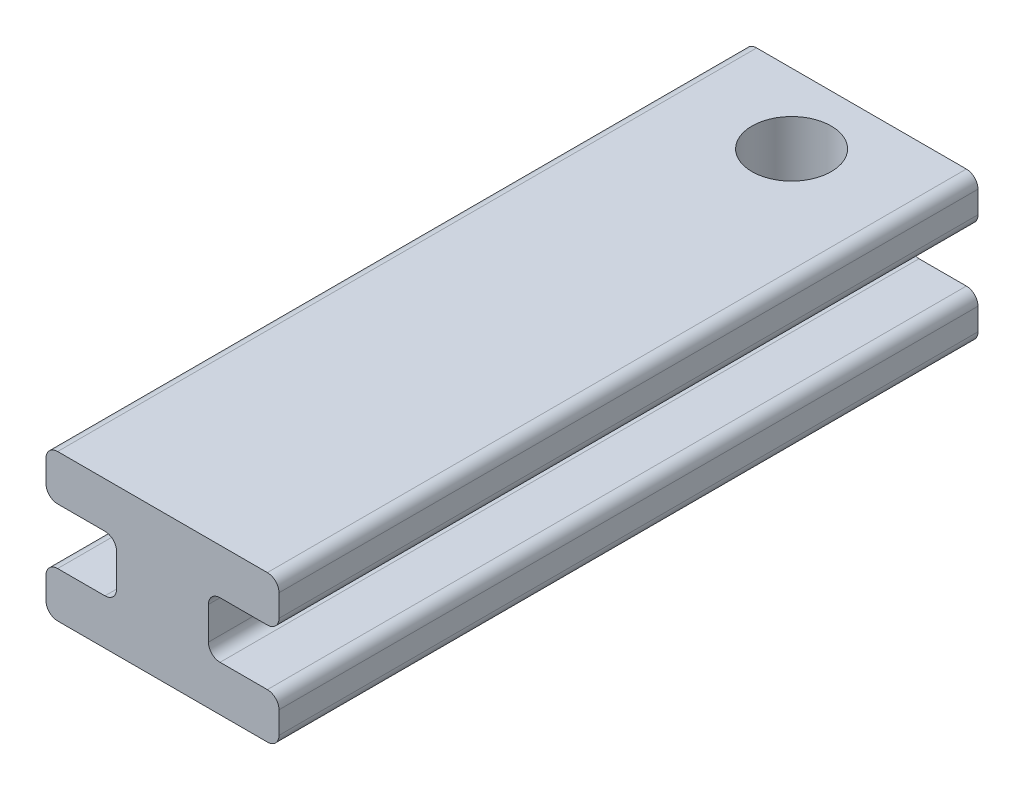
ISO-10303-21;
HEADER;
FILE_DESCRIPTION(('STEP AP214'),'2;1');
FILE_NAME('part.step','',(''),(''),'','','');
FILE_SCHEMA(('AUTOMOTIVE_DESIGN { 1 0 10303 214 1 1 1 1 }'));
ENDSEC;
DATA;
#1=APPLICATION_CONTEXT('core data for automotive mechanical design processes');
#2=APPLICATION_PROTOCOL_DEFINITION('international standard','automotive_design',2000,#1);
#3=PRODUCT_CONTEXT('',#1,'mechanical');
#4=PRODUCT('Part','Part','',(#3));
#5=PRODUCT_RELATED_PRODUCT_CATEGORY('part','',(#4));
#6=PRODUCT_DEFINITION_FORMATION('','',#4);
#7=PRODUCT_DEFINITION_CONTEXT('part definition',#1,'design');
#8=PRODUCT_DEFINITION('design','',#6,#7);
#9=PRODUCT_DEFINITION_SHAPE('','',#8);
#10=(LENGTH_UNIT() NAMED_UNIT(*) SI_UNIT(.MILLI.,.METRE.));
#11=(NAMED_UNIT(*) PLANE_ANGLE_UNIT() SI_UNIT($,.RADIAN.));
#12=(NAMED_UNIT(*) SI_UNIT($,.STERADIAN.) SOLID_ANGLE_UNIT());
#13=UNCERTAINTY_MEASURE_WITH_UNIT(LENGTH_MEASURE(1.E-05),#10,'distance_accuracy_value','');
#14=(GEOMETRIC_REPRESENTATION_CONTEXT(3) GLOBAL_UNCERTAINTY_ASSIGNED_CONTEXT((#13)) GLOBAL_UNIT_ASSIGNED_CONTEXT((#10,
#11,#12)) REPRESENTATION_CONTEXT('',''));
#15=CARTESIAN_POINT('',(0.,0.,0.));
#16=DIRECTION('',(0.,0.,1.));
#17=DIRECTION('',(1.,0.,0.));
#18=AXIS2_PLACEMENT_3D('',#15,#16,#17);
#19=CARTESIAN_POINT('',(5.00000000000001,3.15,30.));
#20=DIRECTION('',(-1.,0.,0.));
#21=DIRECTION('',(0.,-1.,0.));
#22=AXIS2_PLACEMENT_3D('',#19,#20,#21);
#23=PLANE('',#22);
#24=DIRECTION('',(0.,1.,0.));
#25=VECTOR('',#24,1.);
#26=CARTESIAN_POINT('',(5.00000000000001,3.15,30.));
#27=LINE('',#26,#25);
#28=CARTESIAN_POINT('',(5.,1.7,30.));
#29=VERTEX_POINT('',#28);
#30=CARTESIAN_POINT('',(5.00000000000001,2.65,30.));
#31=VERTEX_POINT('',#30);
#32=EDGE_CURVE('E237',#29,#31,#27,.T.);
#33=ORIENTED_EDGE('',*,*,#32,.F.);
#34=DIRECTION('',(0.,0.,-1.));
#35=VECTOR('',#34,1.);
#36=CARTESIAN_POINT('',(5.,1.7,30.));
#37=LINE('',#36,#35);
#38=CARTESIAN_POINT('',(5.,1.7,0.));
#39=VERTEX_POINT('',#38);
#40=EDGE_CURVE('E278',#29,#39,#37,.T.);
#41=ORIENTED_EDGE('',*,*,#40,.T.);
#42=DIRECTION('',(0.,1.,0.));
#43=VECTOR('',#42,1.);
#44=CARTESIAN_POINT('',(5.00000000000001,3.15,0.));
#45=LINE('',#44,#43);
#46=CARTESIAN_POINT('',(5.00000000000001,2.65,0.));
#47=VERTEX_POINT('',#46);
#48=EDGE_CURVE('E378',#39,#47,#45,.T.);
#49=ORIENTED_EDGE('',*,*,#48,.T.);
#50=DIRECTION('',(0.,0.,-1.));
#51=VECTOR('',#50,1.);
#52=CARTESIAN_POINT('',(5.00000000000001,2.65,30.));
#53=LINE('',#52,#51);
#54=EDGE_CURVE('E276',#47,#31,#53,.F.);
#55=ORIENTED_EDGE('',*,*,#54,.T.);
#56=EDGE_LOOP('',(#33,#41,#49,#55));
#57=FACE_BOUND('',#56,.T.);
#58=ADVANCED_FACE('F35',(#57),#23,.F.);
#59=CARTESIAN_POINT('',(-4.99999999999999,3.15,30.));
#60=DIRECTION('',(0.,-1.,0.));
#61=DIRECTION('',(1.,0.,0.));
#62=AXIS2_PLACEMENT_3D('',#59,#60,#61);
#63=PLANE('',#62);
#64=CARTESIAN_POINT('',(0.,3.15,3.));
#65=DIRECTION('',(0.,1.,0.));
#66=DIRECTION('',(-1.,0.,0.));
#67=AXIS2_PLACEMENT_3D('',#64,#65,#66);
#68=CIRCLE('',#67,1.7);
#69=CARTESIAN_POINT('',(-1.7,3.15,3.));
#70=VERTEX_POINT('',#69);
#71=EDGE_CURVE('E486',#70,#70,#68,.T.);
#72=ORIENTED_EDGE('',*,*,#71,.F.);
#73=EDGE_LOOP('',(#72));
#74=FACE_BOUND('',#73,.T.);
#75=DIRECTION('',(-1.,0.,0.));
#76=VECTOR('',#75,1.);
#77=CARTESIAN_POINT('',(-4.99999999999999,3.15,30.));
#78=LINE('',#77,#76);
#79=CARTESIAN_POINT('',(4.50000000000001,3.15,30.));
#80=VERTEX_POINT('',#79);
#81=CARTESIAN_POINT('',(-4.5,3.15,30.));
#82=VERTEX_POINT('',#81);
#83=EDGE_CURVE('E478',#80,#82,#78,.T.);
#84=ORIENTED_EDGE('',*,*,#83,.F.);
#85=DIRECTION('',(0.,0.,-1.));
#86=VECTOR('',#85,1.);
#87=CARTESIAN_POINT('',(4.50000000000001,3.15,30.));
#88=LINE('',#87,#86);
#89=CARTESIAN_POINT('',(4.50000000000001,3.15,0.));
#90=VERTEX_POINT('',#89);
#91=EDGE_CURVE('E287',#80,#90,#88,.T.);
#92=ORIENTED_EDGE('',*,*,#91,.T.);
#93=DIRECTION('',(-1.,0.,0.));
#94=VECTOR('',#93,1.);
#95=CARTESIAN_POINT('',(-4.99999999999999,3.15,0.));
#96=LINE('',#95,#94);
#97=CARTESIAN_POINT('',(-4.5,3.15,0.));
#98=VERTEX_POINT('',#97);
#99=EDGE_CURVE('E381',#90,#98,#96,.T.);
#100=ORIENTED_EDGE('',*,*,#99,.T.);
#101=DIRECTION('',(0.,0.,-1.));
#102=VECTOR('',#101,1.);
#103=CARTESIAN_POINT('',(-4.5,3.15,30.));
#104=LINE('',#103,#102);
#105=EDGE_CURVE('E285',#98,#82,#104,.F.);
#106=ORIENTED_EDGE('',*,*,#105,.T.);
#107=EDGE_LOOP('',(#84,#92,#100,#106));
#108=FACE_BOUND('',#107,.T.);
#109=ADVANCED_FACE('F417',(#74,#108),#63,.F.);
#110=CARTESIAN_POINT('',(-4.99999999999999,3.15,30.));
#111=DIRECTION('',(1.,0.,0.));
#112=DIRECTION('',(0.,1.,0.));
#113=AXIS2_PLACEMENT_3D('',#110,#111,#112);
#114=PLANE('',#113);
#115=DIRECTION('',(0.,-1.,0.));
#116=VECTOR('',#115,1.);
#117=CARTESIAN_POINT('',(-4.99999999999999,3.15,30.));
#118=LINE('',#117,#116);
#119=CARTESIAN_POINT('',(-4.99999999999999,2.65,30.));
#120=VERTEX_POINT('',#119);
#121=CARTESIAN_POINT('',(-4.99999999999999,1.7,30.));
#122=VERTEX_POINT('',#121);
#123=EDGE_CURVE('E363',#120,#122,#118,.T.);
#124=ORIENTED_EDGE('',*,*,#123,.F.);
#125=DIRECTION('',(0.,0.,-1.));
#126=VECTOR('',#125,1.);
#127=CARTESIAN_POINT('',(-4.99999999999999,2.65,30.));
#128=LINE('',#127,#126);
#129=CARTESIAN_POINT('',(-4.99999999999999,2.65,0.));
#130=VERTEX_POINT('',#129);
#131=EDGE_CURVE('E317',#120,#130,#128,.T.);
#132=ORIENTED_EDGE('',*,*,#131,.T.);
#133=DIRECTION('',(0.,-1.,0.));
#134=VECTOR('',#133,1.);
#135=CARTESIAN_POINT('',(-4.99999999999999,3.15,0.));
#136=LINE('',#135,#134);
#137=CARTESIAN_POINT('',(-4.99999999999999,1.7,0.));
#138=VERTEX_POINT('',#137);
#139=EDGE_CURVE('E344',#130,#138,#136,.T.);
#140=ORIENTED_EDGE('',*,*,#139,.T.);
#141=DIRECTION('',(0.,0.,-1.));
#142=VECTOR('',#141,1.);
#143=CARTESIAN_POINT('',(-4.99999999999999,1.7,30.));
#144=LINE('',#143,#142);
#145=EDGE_CURVE('E315',#138,#122,#144,.F.);
#146=ORIENTED_EDGE('',*,*,#145,.T.);
#147=EDGE_LOOP('',(#124,#132,#140,#146));
#148=FACE_BOUND('',#147,.T.);
#149=ADVANCED_FACE('F423',(#148),#114,.F.);
#150=CARTESIAN_POINT('',(-4.99999999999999,1.2,30.));
#151=DIRECTION('',(0.,1.,0.));
#152=DIRECTION('',(-1.,0.,0.));
#153=AXIS2_PLACEMENT_3D('',#150,#151,#152);
#154=PLANE('',#153);
#155=DIRECTION('',(1.,0.,0.));
#156=VECTOR('',#155,1.);
#157=CARTESIAN_POINT('',(-4.99999999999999,1.2,0.));
#158=LINE('',#157,#156);
#159=CARTESIAN_POINT('',(-4.49999999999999,1.2,0.));
#160=VERTEX_POINT('',#159);
#161=CARTESIAN_POINT('',(-2.46999999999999,1.2,0.));
#162=VERTEX_POINT('',#161);
#163=EDGE_CURVE('E333',#160,#162,#158,.T.);
#164=ORIENTED_EDGE('',*,*,#163,.T.);
#165=DIRECTION('',(0.,0.,-1.));
#166=VECTOR('',#165,1.);
#167=CARTESIAN_POINT('',(-2.46999999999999,1.2,30.));
#168=LINE('',#167,#166);
#169=CARTESIAN_POINT('',(-2.46999999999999,1.2,30.));
#170=VERTEX_POINT('',#169);
#171=EDGE_CURVE('E308',#162,#170,#168,.F.);
#172=ORIENTED_EDGE('',*,*,#171,.T.);
#173=DIRECTION('',(1.,0.,0.));
#174=VECTOR('',#173,1.);
#175=CARTESIAN_POINT('',(-4.99999999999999,1.2,30.));
#176=LINE('',#175,#174);
#177=CARTESIAN_POINT('',(-4.49999999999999,1.2,30.));
#178=VERTEX_POINT('',#177);
#179=EDGE_CURVE('E354',#178,#170,#176,.T.);
#180=ORIENTED_EDGE('',*,*,#179,.F.);
#181=DIRECTION('',(0.,0.,-1.));
#182=VECTOR('',#181,1.);
#183=CARTESIAN_POINT('',(-4.49999999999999,1.2,30.));
#184=LINE('',#183,#182);
#185=EDGE_CURVE('E305',#178,#160,#184,.T.);
#186=ORIENTED_EDGE('',*,*,#185,.T.);
#187=EDGE_LOOP('',(#164,#172,#180,#186));
#188=FACE_BOUND('',#187,.T.);
#189=ADVANCED_FACE('F340',(#188),#154,.F.);
#190=CARTESIAN_POINT('',(-1.96999999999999,1.2,30.));
#191=DIRECTION('',(1.,0.,0.));
#192=DIRECTION('',(0.,0.,-1.));
#193=AXIS2_PLACEMENT_3D('',#190,#191,#192);
#194=PLANE('',#193);
#195=DIRECTION('',(0.,-1.,0.));
#196=VECTOR('',#195,1.);
#197=CARTESIAN_POINT('',(-1.96999999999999,1.2,0.));
#198=LINE('',#197,#196);
#199=CARTESIAN_POINT('',(-1.96999999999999,0.700000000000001,0.));
#200=VERTEX_POINT('',#199);
#201=CARTESIAN_POINT('',(-1.96999999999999,-0.700000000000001,0.));
#202=VERTEX_POINT('',#201);
#203=EDGE_CURVE('E335',#200,#202,#198,.T.);
#204=ORIENTED_EDGE('',*,*,#203,.T.);
#205=DIRECTION('',(0.,0.,-1.));
#206=VECTOR('',#205,1.);
#207=CARTESIAN_POINT('',(-1.96999999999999,-0.700000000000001,30.));
#208=LINE('',#207,#206);
#209=CARTESIAN_POINT('',(-1.96999999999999,-0.700000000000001,30.));
#210=VERTEX_POINT('',#209);
#211=EDGE_CURVE('E303',#202,#210,#208,.F.);
#212=ORIENTED_EDGE('',*,*,#211,.T.);
#213=DIRECTION('',(0.,-1.,0.));
#214=VECTOR('',#213,1.);
#215=CARTESIAN_POINT('',(-1.96999999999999,1.2,30.));
#216=LINE('',#215,#214);
#217=CARTESIAN_POINT('',(-1.96999999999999,0.700000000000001,30.));
#218=VERTEX_POINT('',#217);
#219=EDGE_CURVE('E352',#218,#210,#216,.T.);
#220=ORIENTED_EDGE('',*,*,#219,.F.);
#221=DIRECTION('',(0.,0.,-1.));
#222=VECTOR('',#221,1.);
#223=CARTESIAN_POINT('',(-1.96999999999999,0.700000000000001,0.));
#224=LINE('',#223,#222);
#225=EDGE_CURVE('E300',#218,#200,#224,.T.);
#226=ORIENTED_EDGE('',*,*,#225,.T.);
#227=EDGE_LOOP('',(#204,#212,#220,#226));
#228=FACE_BOUND('',#227,.T.);
#229=ADVANCED_FACE('F356',(#228),#194,.F.);
#230=CARTESIAN_POINT('',(-4.99999999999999,-1.2,30.));
#231=DIRECTION('',(0.,-1.,0.));
#232=DIRECTION('',(1.,0.,0.));
#233=AXIS2_PLACEMENT_3D('',#230,#231,#232);
#234=PLANE('',#233);
#235=DIRECTION('',(-1.,0.,0.));
#236=VECTOR('',#235,1.);
#237=CARTESIAN_POINT('',(-4.99999999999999,-1.2,30.));
#238=LINE('',#237,#236);
#239=CARTESIAN_POINT('',(-2.46999999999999,-1.2,30.));
#240=VERTEX_POINT('',#239);
#241=CARTESIAN_POINT('',(-4.49999999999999,-1.2,30.));
#242=VERTEX_POINT('',#241);
#243=EDGE_CURVE('E358',#240,#242,#238,.T.);
#244=ORIENTED_EDGE('',*,*,#243,.F.);
#245=DIRECTION('',(0.,0.,-1.));
#246=VECTOR('',#245,1.);
#247=CARTESIAN_POINT('',(-2.46999999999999,-1.2,0.));
#248=LINE('',#247,#246);
#249=CARTESIAN_POINT('',(-2.46999999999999,-1.2,0.));
#250=VERTEX_POINT('',#249);
#251=EDGE_CURVE('E297',#240,#250,#248,.T.);
#252=ORIENTED_EDGE('',*,*,#251,.T.);
#253=DIRECTION('',(-1.,0.,0.));
#254=VECTOR('',#253,1.);
#255=CARTESIAN_POINT('',(-4.99999999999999,-1.2,0.));
#256=LINE('',#255,#254);
#257=CARTESIAN_POINT('',(-4.49999999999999,-1.2,0.));
#258=VERTEX_POINT('',#257);
#259=EDGE_CURVE('E388',#250,#258,#256,.T.);
#260=ORIENTED_EDGE('',*,*,#259,.T.);
#261=DIRECTION('',(0.,0.,-1.));
#262=VECTOR('',#261,1.);
#263=CARTESIAN_POINT('',(-4.49999999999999,-1.2,30.));
#264=LINE('',#263,#262);
#265=EDGE_CURVE('E295',#258,#242,#264,.F.);
#266=ORIENTED_EDGE('',*,*,#265,.T.);
#267=EDGE_LOOP('',(#244,#252,#260,#266));
#268=FACE_BOUND('',#267,.T.);
#269=ADVANCED_FACE('F413',(#268),#234,.F.);
#270=CARTESIAN_POINT('',(-4.99999999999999,-3.15,30.));
#271=DIRECTION('',(1.,0.,0.));
#272=DIRECTION('',(0.,1.,0.));
#273=AXIS2_PLACEMENT_3D('',#270,#271,#272);
#274=PLANE('',#273);
#275=DIRECTION('',(0.,-1.,0.));
#276=VECTOR('',#275,1.);
#277=CARTESIAN_POINT('',(-4.99999999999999,-3.15,0.));
#278=LINE('',#277,#276);
#279=CARTESIAN_POINT('',(-4.99999999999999,-1.7,0.));
#280=VERTEX_POINT('',#279);
#281=CARTESIAN_POINT('',(-4.99999999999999,-2.65,0.));
#282=VERTEX_POINT('',#281);
#283=EDGE_CURVE('E229',#280,#282,#278,.T.);
#284=ORIENTED_EDGE('',*,*,#283,.T.);
#285=DIRECTION('',(0.,0.,-1.));
#286=VECTOR('',#285,1.);
#287=CARTESIAN_POINT('',(-4.99999999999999,-2.65,30.));
#288=LINE('',#287,#286);
#289=CARTESIAN_POINT('',(-4.99999999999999,-2.65,30.));
#290=VERTEX_POINT('',#289);
#291=EDGE_CURVE('E313',#282,#290,#288,.F.);
#292=ORIENTED_EDGE('',*,*,#291,.T.);
#293=DIRECTION('',(0.,-1.,0.));
#294=VECTOR('',#293,1.);
#295=CARTESIAN_POINT('',(-4.99999999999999,-3.15,30.));
#296=LINE('',#295,#294);
#297=CARTESIAN_POINT('',(-4.99999999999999,-1.7,30.));
#298=VERTEX_POINT('',#297);
#299=EDGE_CURVE('E361',#298,#290,#296,.T.);
#300=ORIENTED_EDGE('',*,*,#299,.F.);
#301=DIRECTION('',(0.,0.,-1.));
#302=VECTOR('',#301,1.);
#303=CARTESIAN_POINT('',(-4.99999999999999,-1.7,30.));
#304=LINE('',#303,#302);
#305=EDGE_CURVE('E310',#298,#280,#304,.T.);
#306=ORIENTED_EDGE('',*,*,#305,.T.);
#307=EDGE_LOOP('',(#284,#292,#300,#306));
#308=FACE_BOUND('',#307,.T.);
#309=ADVANCED_FACE('F394',(#308),#274,.F.);
#310=CARTESIAN_POINT('',(-4.99999999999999,-3.15,30.));
#311=DIRECTION('',(0.,1.,0.));
#312=DIRECTION('',(-1.,0.,0.));
#313=AXIS2_PLACEMENT_3D('',#310,#311,#312);
#314=PLANE('',#313);
#315=CARTESIAN_POINT('',(0.,-3.15,3.));
#316=DIRECTION('',(0.,1.,0.));
#317=DIRECTION('',(-1.,0.,0.));
#318=AXIS2_PLACEMENT_3D('',#315,#316,#317);
#319=CIRCLE('',#318,1.7);
#320=CARTESIAN_POINT('',(-1.7,-3.15,3.));
#321=VERTEX_POINT('',#320);
#322=EDGE_CURVE('E382',#321,#321,#319,.T.);
#323=ORIENTED_EDGE('',*,*,#322,.T.);
#324=EDGE_LOOP('',(#323));
#325=FACE_BOUND('',#324,.T.);
#326=DIRECTION('',(1.,0.,0.));
#327=VECTOR('',#326,1.);
#328=CARTESIAN_POINT('',(-4.99999999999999,-3.15,0.));
#329=LINE('',#328,#327);
#330=CARTESIAN_POINT('',(-4.5,-3.15,0.));
#331=VERTEX_POINT('',#330);
#332=CARTESIAN_POINT('',(4.50000000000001,-3.15,0.));
#333=VERTEX_POINT('',#332);
#334=EDGE_CURVE('E224',#331,#333,#329,.T.);
#335=ORIENTED_EDGE('',*,*,#334,.T.);
#336=DIRECTION('',(0.,0.,-1.));
#337=VECTOR('',#336,1.);
#338=CARTESIAN_POINT('',(4.50000000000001,-3.15,30.));
#339=LINE('',#338,#337);
#340=CARTESIAN_POINT('',(4.50000000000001,-3.15,30.));
#341=VERTEX_POINT('',#340);
#342=EDGE_CURVE('E202',#333,#341,#339,.F.);
#343=ORIENTED_EDGE('',*,*,#342,.T.);
#344=DIRECTION('',(1.,0.,0.));
#345=VECTOR('',#344,1.);
#346=CARTESIAN_POINT('',(-4.99999999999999,-3.15,30.));
#347=LINE('',#346,#345);
#348=CARTESIAN_POINT('',(-4.5,-3.15,30.));
#349=VERTEX_POINT('',#348);
#350=EDGE_CURVE('E369',#349,#341,#347,.T.);
#351=ORIENTED_EDGE('',*,*,#350,.F.);
#352=DIRECTION('',(0.,0.,-1.));
#353=VECTOR('',#352,1.);
#354=CARTESIAN_POINT('',(-4.5,-3.15,30.));
#355=LINE('',#354,#353);
#356=EDGE_CURVE('E207',#349,#331,#355,.T.);
#357=ORIENTED_EDGE('',*,*,#356,.T.);
#358=EDGE_LOOP('',(#335,#343,#351,#357));
#359=FACE_BOUND('',#358,.T.);
#360=ADVANCED_FACE('F403',(#325,#359),#314,.F.);
#361=CARTESIAN_POINT('',(5.00000000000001,-3.15,30.));
#362=DIRECTION('',(-1.,0.,0.));
#363=DIRECTION('',(0.,-1.,0.));
#364=AXIS2_PLACEMENT_3D('',#361,#362,#363);
#365=PLANE('',#364);
#366=DIRECTION('',(0.,1.,0.));
#367=VECTOR('',#366,1.);
#368=CARTESIAN_POINT('',(5.00000000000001,-3.15,30.));
#369=LINE('',#368,#367);
#370=CARTESIAN_POINT('',(5.00000000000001,-2.65,30.));
#371=VERTEX_POINT('',#370);
#372=CARTESIAN_POINT('',(5.,-1.7,30.));
#373=VERTEX_POINT('',#372);
#374=EDGE_CURVE('E217',#371,#373,#369,.T.);
#375=ORIENTED_EDGE('',*,*,#374,.F.);
#376=DIRECTION('',(0.,0.,-1.));
#377=VECTOR('',#376,1.);
#378=CARTESIAN_POINT('',(5.00000000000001,-2.65,30.));
#379=LINE('',#378,#377);
#380=CARTESIAN_POINT('',(5.00000000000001,-2.65,0.));
#381=VERTEX_POINT('',#380);
#382=EDGE_CURVE('E201',#371,#381,#379,.T.);
#383=ORIENTED_EDGE('',*,*,#382,.T.);
#384=DIRECTION('',(0.,1.,0.));
#385=VECTOR('',#384,1.);
#386=CARTESIAN_POINT('',(5.00000000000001,-3.15,0.));
#387=LINE('',#386,#385);
#388=CARTESIAN_POINT('',(5.,-1.7,0.));
#389=VERTEX_POINT('',#388);
#390=EDGE_CURVE('E214',#381,#389,#387,.T.);
#391=ORIENTED_EDGE('',*,*,#390,.T.);
#392=DIRECTION('',(0.,0.,-1.));
#393=VECTOR('',#392,1.);
#394=CARTESIAN_POINT('',(5.,-1.7,30.));
#395=LINE('',#394,#393);
#396=EDGE_CURVE('E219',#389,#373,#395,.F.);
#397=ORIENTED_EDGE('',*,*,#396,.T.);
#398=EDGE_LOOP('',(#375,#383,#391,#397));
#399=FACE_BOUND('',#398,.T.);
#400=ADVANCED_FACE('F213',(#399),#365,.F.);
#401=CARTESIAN_POINT('',(5.,-1.2,30.));
#402=DIRECTION('',(0.,-1.,0.));
#403=DIRECTION('',(1.,0.,0.));
#404=AXIS2_PLACEMENT_3D('',#401,#402,#403);
#405=PLANE('',#404);
#406=DIRECTION('',(-1.,0.,0.));
#407=VECTOR('',#406,1.);
#408=CARTESIAN_POINT('',(5.,-1.2,30.));
#409=LINE('',#408,#407);
#410=CARTESIAN_POINT('',(4.5,-1.2,30.));
#411=VERTEX_POINT('',#410);
#412=CARTESIAN_POINT('',(2.47000000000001,-1.2,30.));
#413=VERTEX_POINT('',#412);
#414=EDGE_CURVE('E372',#411,#413,#409,.T.);
#415=ORIENTED_EDGE('',*,*,#414,.F.);
#416=DIRECTION('',(0.,0.,-1.));
#417=VECTOR('',#416,1.);
#418=CARTESIAN_POINT('',(4.5,-1.2,30.));
#419=LINE('',#418,#417);
#420=CARTESIAN_POINT('',(4.5,-1.2,0.));
#421=VERTEX_POINT('',#420);
#422=EDGE_CURVE('E273',#411,#421,#419,.T.);
#423=ORIENTED_EDGE('',*,*,#422,.T.);
#424=DIRECTION('',(-1.,0.,0.));
#425=VECTOR('',#424,1.);
#426=CARTESIAN_POINT('',(5.,-1.2,0.));
#427=LINE('',#426,#425);
#428=CARTESIAN_POINT('',(2.47000000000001,-1.2,0.));
#429=VERTEX_POINT('',#428);
#430=EDGE_CURVE('E223',#421,#429,#427,.T.);
#431=ORIENTED_EDGE('',*,*,#430,.T.);
#432=DIRECTION('',(0.,0.,-1.));
#433=VECTOR('',#432,1.);
#434=CARTESIAN_POINT('',(2.47000000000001,-1.2,30.));
#435=LINE('',#434,#433);
#436=EDGE_CURVE('E271',#429,#413,#435,.F.);
#437=ORIENTED_EDGE('',*,*,#436,.T.);
#438=EDGE_LOOP('',(#415,#423,#431,#437));
#439=FACE_BOUND('',#438,.T.);
#440=ADVANCED_FACE('F411',(#439),#405,.F.);
#441=CARTESIAN_POINT('',(1.97,1.2,30.));
#442=DIRECTION('',(-1.,0.,0.));
#443=DIRECTION('',(0.,-1.,0.));
#444=AXIS2_PLACEMENT_3D('',#441,#442,#443);
#445=PLANE('',#444);
#446=DIRECTION('',(0.,1.,0.));
#447=VECTOR('',#446,1.);
#448=CARTESIAN_POINT('',(1.97,0.,30.));
#449=LINE('',#448,#447);
#450=CARTESIAN_POINT('',(1.97,-0.7,30.));
#451=VERTEX_POINT('',#450);
#452=CARTESIAN_POINT('',(1.97000000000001,0.7,30.));
#453=VERTEX_POINT('',#452);
#454=EDGE_CURVE('E375',#451,#453,#449,.T.);
#455=ORIENTED_EDGE('',*,*,#454,.F.);
#456=DIRECTION('',(0.,0.,-1.));
#457=VECTOR('',#456,1.);
#458=CARTESIAN_POINT('',(1.97000000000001,-0.7,0.));
#459=LINE('',#458,#457);
#460=CARTESIAN_POINT('',(1.97000000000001,-0.7,0.));
#461=VERTEX_POINT('',#460);
#462=EDGE_CURVE('E292',#451,#461,#459,.T.);
#463=ORIENTED_EDGE('',*,*,#462,.T.);
#464=DIRECTION('',(0.,1.,0.));
#465=VECTOR('',#464,1.);
#466=CARTESIAN_POINT('',(1.97,1.2,0.));
#467=LINE('',#466,#465);
#468=CARTESIAN_POINT('',(1.97,0.7,0.));
#469=VERTEX_POINT('',#468);
#470=EDGE_CURVE('E227',#461,#469,#467,.T.);
#471=ORIENTED_EDGE('',*,*,#470,.T.);
#472=DIRECTION('',(0.,0.,-1.));
#473=VECTOR('',#472,1.);
#474=CARTESIAN_POINT('',(1.97,0.7,30.));
#475=LINE('',#474,#473);
#476=EDGE_CURVE('E290',#469,#453,#475,.F.);
#477=ORIENTED_EDGE('',*,*,#476,.T.);
#478=EDGE_LOOP('',(#455,#463,#471,#477));
#479=FACE_BOUND('',#478,.T.);
#480=ADVANCED_FACE('F510',(#479),#445,.F.);
#481=CARTESIAN_POINT('',(5.,1.2,30.));
#482=DIRECTION('',(0.,1.,0.));
#483=DIRECTION('',(-1.,0.,0.));
#484=AXIS2_PLACEMENT_3D('',#481,#482,#483);
#485=PLANE('',#484);
#486=DIRECTION('',(1.,0.,0.));
#487=VECTOR('',#486,1.);
#488=CARTESIAN_POINT('',(5.,1.2,0.));
#489=LINE('',#488,#487);
#490=CARTESIAN_POINT('',(2.47000000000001,1.2,0.));
#491=VERTEX_POINT('',#490);
#492=CARTESIAN_POINT('',(4.5,1.2,0.));
#493=VERTEX_POINT('',#492);
#494=EDGE_CURVE('E235',#491,#493,#489,.T.);
#495=ORIENTED_EDGE('',*,*,#494,.T.);
#496=DIRECTION('',(0.,0.,-1.));
#497=VECTOR('',#496,1.);
#498=CARTESIAN_POINT('',(4.5,1.2,30.));
#499=LINE('',#498,#497);
#500=CARTESIAN_POINT('',(4.5,1.2,30.));
#501=VERTEX_POINT('',#500);
#502=EDGE_CURVE('E50',#493,#501,#499,.F.);
#503=ORIENTED_EDGE('',*,*,#502,.T.);
#504=DIRECTION('',(1.,0.,0.));
#505=VECTOR('',#504,1.);
#506=CARTESIAN_POINT('',(5.,1.2,30.));
#507=LINE('',#506,#505);
#508=CARTESIAN_POINT('',(2.47000000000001,1.2,30.));
#509=VERTEX_POINT('',#508);
#510=EDGE_CURVE('E238',#509,#501,#507,.T.);
#511=ORIENTED_EDGE('',*,*,#510,.F.);
#512=DIRECTION('',(0.,0.,-1.));
#513=VECTOR('',#512,1.);
#514=CARTESIAN_POINT('',(2.47,1.2,0.));
#515=LINE('',#514,#513);
#516=EDGE_CURVE('E281',#509,#491,#515,.T.);
#517=ORIENTED_EDGE('',*,*,#516,.T.);
#518=EDGE_LOOP('',(#495,#503,#511,#517));
#519=FACE_BOUND('',#518,.T.);
#520=ADVANCED_FACE('F504',(#519),#485,.F.);
#521=CARTESIAN_POINT('',(0.,0.,30.));
#522=DIRECTION('',(0.,0.,-1.));
#523=DIRECTION('',(-1.,0.,0.));
#524=AXIS2_PLACEMENT_3D('',#521,#522,#523);
#525=PLANE('',#524);
#526=ORIENTED_EDGE('',*,*,#350,.T.);
#527=CARTESIAN_POINT('',(4.50000000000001,-2.65,30.));
#528=DIRECTION('',(0.,0.,-1.));
#529=DIRECTION('',(-1.,0.,0.));
#530=AXIS2_PLACEMENT_3D('',#527,#528,#529);
#531=CIRCLE('',#530,0.5);
#532=EDGE_CURVE('E269',#341,#371,#531,.F.);
#533=ORIENTED_EDGE('',*,*,#532,.T.);
#534=ORIENTED_EDGE('',*,*,#374,.T.);
#535=CARTESIAN_POINT('',(4.5,-1.7,30.));
#536=DIRECTION('',(0.,0.,-1.));
#537=DIRECTION('',(-1.,0.,0.));
#538=AXIS2_PLACEMENT_3D('',#535,#536,#537);
#539=CIRCLE('',#538,0.5);
#540=EDGE_CURVE('E267',#373,#411,#539,.F.);
#541=ORIENTED_EDGE('',*,*,#540,.T.);
#542=ORIENTED_EDGE('',*,*,#414,.T.);
#543=CARTESIAN_POINT('',(2.47000000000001,-0.7,30.));
#544=DIRECTION('',(0.,0.,-1.));
#545=DIRECTION('',(-1.,0.,0.));
#546=AXIS2_PLACEMENT_3D('',#543,#544,#545);
#547=CIRCLE('',#546,0.5);
#548=EDGE_CURVE('E322',#413,#451,#547,.T.);
#549=ORIENTED_EDGE('',*,*,#548,.T.);
#550=ORIENTED_EDGE('',*,*,#454,.T.);
#551=CARTESIAN_POINT('',(2.47,0.7,30.));
#552=DIRECTION('',(0.,0.,-1.));
#553=DIRECTION('',(-1.,0.,0.));
#554=AXIS2_PLACEMENT_3D('',#551,#552,#553);
#555=CIRCLE('',#554,0.5);
#556=EDGE_CURVE('E57',#453,#509,#555,.T.);
#557=ORIENTED_EDGE('',*,*,#556,.T.);
#558=ORIENTED_EDGE('',*,*,#510,.T.);
#559=CARTESIAN_POINT('',(4.5,1.7,30.));
#560=DIRECTION('',(0.,0.,-1.));
#561=DIRECTION('',(-1.,0.,0.));
#562=AXIS2_PLACEMENT_3D('',#559,#560,#561);
#563=CIRCLE('',#562,0.5);
#564=EDGE_CURVE('E265',#501,#29,#563,.F.);
#565=ORIENTED_EDGE('',*,*,#564,.T.);
#566=ORIENTED_EDGE('',*,*,#32,.T.);
#567=CARTESIAN_POINT('',(4.50000000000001,2.65,30.));
#568=DIRECTION('',(0.,0.,-1.));
#569=DIRECTION('',(-1.,0.,0.));
#570=AXIS2_PLACEMENT_3D('',#567,#568,#569);
#571=CIRCLE('',#570,0.5);
#572=EDGE_CURVE('E263',#31,#80,#571,.F.);
#573=ORIENTED_EDGE('',*,*,#572,.T.);
#574=ORIENTED_EDGE('',*,*,#83,.T.);
#575=CARTESIAN_POINT('',(-4.5,2.65,30.));
#576=DIRECTION('',(0.,0.,-1.));
#577=DIRECTION('',(-1.,0.,0.));
#578=AXIS2_PLACEMENT_3D('',#575,#576,#577);
#579=CIRCLE('',#578,0.5);
#580=EDGE_CURVE('E257',#82,#120,#579,.F.);
#581=ORIENTED_EDGE('',*,*,#580,.T.);
#582=ORIENTED_EDGE('',*,*,#123,.T.);
#583=CARTESIAN_POINT('',(-4.49999999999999,1.7,30.));
#584=DIRECTION('',(0.,0.,-1.));
#585=DIRECTION('',(-1.,0.,0.));
#586=AXIS2_PLACEMENT_3D('',#583,#584,#585);
#587=CIRCLE('',#586,0.5);
#588=EDGE_CURVE('E255',#122,#178,#587,.F.);
#589=ORIENTED_EDGE('',*,*,#588,.T.);
#590=ORIENTED_EDGE('',*,*,#179,.T.);
#591=CARTESIAN_POINT('',(-2.46999999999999,0.700000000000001,30.));
#592=DIRECTION('',(0.,0.,-1.));
#593=DIRECTION('',(-1.,0.,0.));
#594=AXIS2_PLACEMENT_3D('',#591,#592,#593);
#595=CIRCLE('',#594,0.5);
#596=EDGE_CURVE('E11',#170,#218,#595,.T.);
#597=ORIENTED_EDGE('',*,*,#596,.T.);
#598=ORIENTED_EDGE('',*,*,#219,.T.);
#599=CARTESIAN_POINT('',(-2.46999999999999,-0.700000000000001,30.));
#600=DIRECTION('',(0.,0.,-1.));
#601=DIRECTION('',(-1.,0.,0.));
#602=AXIS2_PLACEMENT_3D('',#599,#600,#601);
#603=CIRCLE('',#602,0.5);
#604=EDGE_CURVE('E329',#210,#240,#603,.T.);
#605=ORIENTED_EDGE('',*,*,#604,.T.);
#606=ORIENTED_EDGE('',*,*,#243,.T.);
#607=CARTESIAN_POINT('',(-4.49999999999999,-1.7,30.));
#608=DIRECTION('',(0.,0.,-1.));
#609=DIRECTION('',(-1.,0.,0.));
#610=AXIS2_PLACEMENT_3D('',#607,#608,#609);
#611=CIRCLE('',#610,0.5);
#612=EDGE_CURVE('E259',#242,#298,#611,.F.);
#613=ORIENTED_EDGE('',*,*,#612,.T.);
#614=ORIENTED_EDGE('',*,*,#299,.T.);
#615=CARTESIAN_POINT('',(-4.5,-2.65,30.));
#616=DIRECTION('',(0.,0.,-1.));
#617=DIRECTION('',(-1.,0.,0.));
#618=AXIS2_PLACEMENT_3D('',#615,#616,#617);
#619=CIRCLE('',#618,0.5);
#620=EDGE_CURVE('E261',#290,#349,#619,.F.);
#621=ORIENTED_EDGE('',*,*,#620,.T.);
#622=EDGE_LOOP('',(#526,#533,#534,#541,#542,#549,#550,#557,#558,#565,#566,#573,#574,#581,#582,
#589,#590,#597,#598,#605,#606,#613,#614,#621));
#623=FACE_BOUND('',#622,.T.);
#624=ADVANCED_FACE('F351',(#623),#525,.F.);
#625=CARTESIAN_POINT('',(0.,0.,0.));
#626=DIRECTION('',(0.,0.,-1.));
#627=DIRECTION('',(-1.,0.,0.));
#628=AXIS2_PLACEMENT_3D('',#625,#626,#627);
#629=PLANE('',#628);
#630=ORIENTED_EDGE('',*,*,#390,.F.);
#631=CARTESIAN_POINT('',(4.50000000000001,-2.65,0.));
#632=DIRECTION('',(0.,0.,-1.));
#633=DIRECTION('',(-1.,0.,0.));
#634=AXIS2_PLACEMENT_3D('',#631,#632,#633);
#635=CIRCLE('',#634,0.5);
#636=EDGE_CURVE('E197',#381,#333,#635,.T.);
#637=ORIENTED_EDGE('',*,*,#636,.T.);
#638=ORIENTED_EDGE('',*,*,#334,.F.);
#639=CARTESIAN_POINT('',(-4.5,-2.65,0.));
#640=DIRECTION('',(0.,0.,-1.));
#641=DIRECTION('',(-1.,0.,0.));
#642=AXIS2_PLACEMENT_3D('',#639,#640,#641);
#643=CIRCLE('',#642,0.5);
#644=EDGE_CURVE('E245',#331,#282,#643,.T.);
#645=ORIENTED_EDGE('',*,*,#644,.T.);
#646=ORIENTED_EDGE('',*,*,#283,.F.);
#647=CARTESIAN_POINT('',(-4.49999999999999,-1.7,0.));
#648=DIRECTION('',(0.,0.,-1.));
#649=DIRECTION('',(-1.,0.,0.));
#650=AXIS2_PLACEMENT_3D('',#647,#648,#649);
#651=CIRCLE('',#650,0.5);
#652=EDGE_CURVE('E243',#280,#258,#651,.T.);
#653=ORIENTED_EDGE('',*,*,#652,.T.);
#654=ORIENTED_EDGE('',*,*,#259,.F.);
#655=CARTESIAN_POINT('',(-2.46999999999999,-0.700000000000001,0.));
#656=DIRECTION('',(0.,0.,-1.));
#657=DIRECTION('',(-1.,0.,0.));
#658=AXIS2_PLACEMENT_3D('',#655,#656,#657);
#659=CIRCLE('',#658,0.5);
#660=EDGE_CURVE('E327',#250,#202,#659,.F.);
#661=ORIENTED_EDGE('',*,*,#660,.T.);
#662=ORIENTED_EDGE('',*,*,#203,.F.);
#663=CARTESIAN_POINT('',(-2.46999999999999,0.700000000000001,0.));
#664=DIRECTION('',(0.,0.,-1.));
#665=DIRECTION('',(-1.,0.,0.));
#666=AXIS2_PLACEMENT_3D('',#663,#664,#665);
#667=CIRCLE('',#666,0.5);
#668=EDGE_CURVE('E43',#200,#162,#667,.F.);
#669=ORIENTED_EDGE('',*,*,#668,.T.);
#670=ORIENTED_EDGE('',*,*,#163,.F.);
#671=CARTESIAN_POINT('',(-4.49999999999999,1.7,0.));
#672=DIRECTION('',(0.,0.,-1.));
#673=DIRECTION('',(-1.,0.,0.));
#674=AXIS2_PLACEMENT_3D('',#671,#672,#673);
#675=CIRCLE('',#674,0.5);
#676=EDGE_CURVE('E218',#160,#138,#675,.T.);
#677=ORIENTED_EDGE('',*,*,#676,.T.);
#678=ORIENTED_EDGE('',*,*,#139,.F.);
#679=CARTESIAN_POINT('',(-4.5,2.65,0.));
#680=DIRECTION('',(0.,0.,-1.));
#681=DIRECTION('',(-1.,0.,0.));
#682=AXIS2_PLACEMENT_3D('',#679,#680,#681);
#683=CIRCLE('',#682,0.5);
#684=EDGE_CURVE('E241',#130,#98,#683,.T.);
#685=ORIENTED_EDGE('',*,*,#684,.T.);
#686=ORIENTED_EDGE('',*,*,#99,.F.);
#687=CARTESIAN_POINT('',(4.50000000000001,2.65,0.));
#688=DIRECTION('',(0.,0.,-1.));
#689=DIRECTION('',(-1.,0.,0.));
#690=AXIS2_PLACEMENT_3D('',#687,#688,#689);
#691=CIRCLE('',#690,0.5);
#692=EDGE_CURVE('E247',#90,#47,#691,.T.);
#693=ORIENTED_EDGE('',*,*,#692,.T.);
#694=ORIENTED_EDGE('',*,*,#48,.F.);
#695=CARTESIAN_POINT('',(4.5,1.7,0.));
#696=DIRECTION('',(0.,0.,-1.));
#697=DIRECTION('',(-1.,0.,0.));
#698=AXIS2_PLACEMENT_3D('',#695,#696,#697);
#699=CIRCLE('',#698,0.5);
#700=EDGE_CURVE('E249',#39,#493,#699,.T.);
#701=ORIENTED_EDGE('',*,*,#700,.T.);
#702=ORIENTED_EDGE('',*,*,#494,.F.);
#703=CARTESIAN_POINT('',(2.47,0.7,0.));
#704=DIRECTION('',(0.,0.,-1.));
#705=DIRECTION('',(-1.,0.,0.));
#706=AXIS2_PLACEMENT_3D('',#703,#704,#705);
#707=CIRCLE('',#706,0.5);
#708=EDGE_CURVE('E324',#491,#469,#707,.F.);
#709=ORIENTED_EDGE('',*,*,#708,.T.);
#710=ORIENTED_EDGE('',*,*,#470,.F.);
#711=CARTESIAN_POINT('',(2.47000000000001,-0.7,0.));
#712=DIRECTION('',(0.,0.,-1.));
#713=DIRECTION('',(-1.,0.,0.));
#714=AXIS2_PLACEMENT_3D('',#711,#712,#713);
#715=CIRCLE('',#714,0.5);
#716=EDGE_CURVE('E320',#461,#429,#715,.F.);
#717=ORIENTED_EDGE('',*,*,#716,.T.);
#718=ORIENTED_EDGE('',*,*,#430,.F.);
#719=CARTESIAN_POINT('',(4.5,-1.7,0.));
#720=DIRECTION('',(0.,0.,-1.));
#721=DIRECTION('',(-1.,0.,0.));
#722=AXIS2_PLACEMENT_3D('',#719,#720,#721);
#723=CIRCLE('',#722,0.5);
#724=EDGE_CURVE('E208',#421,#389,#723,.T.);
#725=ORIENTED_EDGE('',*,*,#724,.T.);
#726=EDGE_LOOP('',(#630,#637,#638,#645,#646,#653,#654,#661,#662,#669,#670,#677,#678,#685,#686,
#693,#694,#701,#702,#709,#710,#717,#718,#725));
#727=FACE_BOUND('',#726,.T.);
#728=ADVANCED_FACE('F221',(#727),#629,.T.);
#729=CARTESIAN_POINT('',(4.50000000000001,-2.65,30.));
#730=DIRECTION('',(0.,0.,-1.));
#731=DIRECTION('',(-1.,0.,0.));
#732=AXIS2_PLACEMENT_3D('',#729,#730,#731);
#733=CYLINDRICAL_SURFACE('',#732,0.5);
#734=ORIENTED_EDGE('',*,*,#532,.F.);
#735=ORIENTED_EDGE('',*,*,#342,.F.);
#736=ORIENTED_EDGE('',*,*,#636,.F.);
#737=ORIENTED_EDGE('',*,*,#382,.F.);
#738=EDGE_LOOP('',(#734,#735,#736,#737));
#739=FACE_BOUND('',#738,.T.);
#740=ADVANCED_FACE('F200',(#739),#733,.T.);
#741=CARTESIAN_POINT('',(4.5,-1.7,30.));
#742=DIRECTION('',(0.,0.,-1.));
#743=DIRECTION('',(-1.,0.,0.));
#744=AXIS2_PLACEMENT_3D('',#741,#742,#743);
#745=CYLINDRICAL_SURFACE('',#744,0.5);
#746=ORIENTED_EDGE('',*,*,#540,.F.);
#747=ORIENTED_EDGE('',*,*,#396,.F.);
#748=ORIENTED_EDGE('',*,*,#724,.F.);
#749=ORIENTED_EDGE('',*,*,#422,.F.);
#750=EDGE_LOOP('',(#746,#747,#748,#749));
#751=FACE_BOUND('',#750,.T.);
#752=ADVANCED_FACE('F431',(#751),#745,.T.);
#753=CARTESIAN_POINT('',(4.5,1.7,30.));
#754=DIRECTION('',(0.,0.,-1.));
#755=DIRECTION('',(-1.,0.,0.));
#756=AXIS2_PLACEMENT_3D('',#753,#754,#755);
#757=CYLINDRICAL_SURFACE('',#756,0.5);
#758=ORIENTED_EDGE('',*,*,#564,.F.);
#759=ORIENTED_EDGE('',*,*,#502,.F.);
#760=ORIENTED_EDGE('',*,*,#700,.F.);
#761=ORIENTED_EDGE('',*,*,#40,.F.);
#762=EDGE_LOOP('',(#758,#759,#760,#761));
#763=FACE_BOUND('',#762,.T.);
#764=ADVANCED_FACE('F434',(#763),#757,.T.);
#765=CARTESIAN_POINT('',(4.50000000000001,2.65,30.));
#766=DIRECTION('',(0.,0.,-1.));
#767=DIRECTION('',(-1.,0.,0.));
#768=AXIS2_PLACEMENT_3D('',#765,#766,#767);
#769=CYLINDRICAL_SURFACE('',#768,0.5);
#770=ORIENTED_EDGE('',*,*,#572,.F.);
#771=ORIENTED_EDGE('',*,*,#54,.F.);
#772=ORIENTED_EDGE('',*,*,#692,.F.);
#773=ORIENTED_EDGE('',*,*,#91,.F.);
#774=EDGE_LOOP('',(#770,#771,#772,#773));
#775=FACE_BOUND('',#774,.T.);
#776=ADVANCED_FACE('F438',(#775),#769,.T.);
#777=CARTESIAN_POINT('',(2.47000000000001,-0.7,30.));
#778=DIRECTION('',(0.,0.,1.));
#779=DIRECTION('',(1.,0.,0.));
#780=AXIS2_PLACEMENT_3D('',#777,#778,#779);
#781=CYLINDRICAL_SURFACE('',#780,0.5);
#782=ORIENTED_EDGE('',*,*,#548,.F.);
#783=ORIENTED_EDGE('',*,*,#436,.F.);
#784=ORIENTED_EDGE('',*,*,#716,.F.);
#785=ORIENTED_EDGE('',*,*,#462,.F.);
#786=EDGE_LOOP('',(#782,#783,#784,#785));
#787=FACE_BOUND('',#786,.T.);
#788=ADVANCED_FACE('F442',(#787),#781,.F.);
#789=CARTESIAN_POINT('',(2.47,0.7,30.));
#790=DIRECTION('',(0.,0.,1.));
#791=DIRECTION('',(1.,0.,0.));
#792=AXIS2_PLACEMENT_3D('',#789,#790,#791);
#793=CYLINDRICAL_SURFACE('',#792,0.5);
#794=ORIENTED_EDGE('',*,*,#556,.F.);
#795=ORIENTED_EDGE('',*,*,#476,.F.);
#796=ORIENTED_EDGE('',*,*,#708,.F.);
#797=ORIENTED_EDGE('',*,*,#516,.F.);
#798=EDGE_LOOP('',(#794,#795,#796,#797));
#799=FACE_BOUND('',#798,.T.);
#800=ADVANCED_FACE('F446',(#799),#793,.F.);
#801=CARTESIAN_POINT('',(-2.46999999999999,-0.700000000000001,30.));
#802=DIRECTION('',(0.,0.,1.));
#803=DIRECTION('',(1.,0.,0.));
#804=AXIS2_PLACEMENT_3D('',#801,#802,#803);
#805=CYLINDRICAL_SURFACE('',#804,0.5);
#806=ORIENTED_EDGE('',*,*,#604,.F.);
#807=ORIENTED_EDGE('',*,*,#211,.F.);
#808=ORIENTED_EDGE('',*,*,#660,.F.);
#809=ORIENTED_EDGE('',*,*,#251,.F.);
#810=EDGE_LOOP('',(#806,#807,#808,#809));
#811=FACE_BOUND('',#810,.T.);
#812=ADVANCED_FACE('F450',(#811),#805,.F.);
#813=CARTESIAN_POINT('',(-2.46999999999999,0.700000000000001,30.));
#814=DIRECTION('',(0.,0.,1.));
#815=DIRECTION('',(1.,0.,0.));
#816=AXIS2_PLACEMENT_3D('',#813,#814,#815);
#817=CYLINDRICAL_SURFACE('',#816,0.5);
#818=ORIENTED_EDGE('',*,*,#596,.F.);
#819=ORIENTED_EDGE('',*,*,#171,.F.);
#820=ORIENTED_EDGE('',*,*,#668,.F.);
#821=ORIENTED_EDGE('',*,*,#225,.F.);
#822=EDGE_LOOP('',(#818,#819,#820,#821));
#823=FACE_BOUND('',#822,.T.);
#824=ADVANCED_FACE('F347',(#823),#817,.F.);
#825=CARTESIAN_POINT('',(-4.5,-2.65,30.));
#826=DIRECTION('',(0.,0.,-1.));
#827=DIRECTION('',(-1.,0.,0.));
#828=AXIS2_PLACEMENT_3D('',#825,#826,#827);
#829=CYLINDRICAL_SURFACE('',#828,0.5);
#830=ORIENTED_EDGE('',*,*,#620,.F.);
#831=ORIENTED_EDGE('',*,*,#291,.F.);
#832=ORIENTED_EDGE('',*,*,#644,.F.);
#833=ORIENTED_EDGE('',*,*,#356,.F.);
#834=EDGE_LOOP('',(#830,#831,#832,#833));
#835=FACE_BOUND('',#834,.T.);
#836=ADVANCED_FACE('F399',(#835),#829,.T.);
#837=CARTESIAN_POINT('',(-4.49999999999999,-1.7,30.));
#838=DIRECTION('',(0.,0.,-1.));
#839=DIRECTION('',(-1.,0.,0.));
#840=AXIS2_PLACEMENT_3D('',#837,#838,#839);
#841=CYLINDRICAL_SURFACE('',#840,0.5);
#842=ORIENTED_EDGE('',*,*,#612,.F.);
#843=ORIENTED_EDGE('',*,*,#265,.F.);
#844=ORIENTED_EDGE('',*,*,#652,.F.);
#845=ORIENTED_EDGE('',*,*,#305,.F.);
#846=EDGE_LOOP('',(#842,#843,#844,#845));
#847=FACE_BOUND('',#846,.T.);
#848=ADVANCED_FACE('F459',(#847),#841,.T.);
#849=CARTESIAN_POINT('',(-4.5,2.65,30.));
#850=DIRECTION('',(0.,0.,-1.));
#851=DIRECTION('',(-1.,0.,0.));
#852=AXIS2_PLACEMENT_3D('',#849,#850,#851);
#853=CYLINDRICAL_SURFACE('',#852,0.5);
#854=ORIENTED_EDGE('',*,*,#580,.F.);
#855=ORIENTED_EDGE('',*,*,#105,.F.);
#856=ORIENTED_EDGE('',*,*,#684,.F.);
#857=ORIENTED_EDGE('',*,*,#131,.F.);
#858=EDGE_LOOP('',(#854,#855,#856,#857));
#859=FACE_BOUND('',#858,.T.);
#860=ADVANCED_FACE('F461',(#859),#853,.T.);
#861=CARTESIAN_POINT('',(-4.49999999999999,1.7,30.));
#862=DIRECTION('',(0.,0.,-1.));
#863=DIRECTION('',(-1.,0.,0.));
#864=AXIS2_PLACEMENT_3D('',#861,#862,#863);
#865=CYLINDRICAL_SURFACE('',#864,0.5);
#866=ORIENTED_EDGE('',*,*,#588,.F.);
#867=ORIENTED_EDGE('',*,*,#145,.F.);
#868=ORIENTED_EDGE('',*,*,#676,.F.);
#869=ORIENTED_EDGE('',*,*,#185,.F.);
#870=EDGE_LOOP('',(#866,#867,#868,#869));
#871=FACE_BOUND('',#870,.T.);
#872=ADVANCED_FACE('F37',(#871),#865,.T.);
#873=CARTESIAN_POINT('',(0.,-3.15,3.));
#874=DIRECTION('',(0.,1.,0.));
#875=DIRECTION('',(-1.,0.,0.));
#876=AXIS2_PLACEMENT_3D('',#873,#874,#875);
#877=CYLINDRICAL_SURFACE('',#876,1.7);
#878=ORIENTED_EDGE('',*,*,#322,.F.);
#879=EDGE_LOOP('',(#878));
#880=FACE_BOUND('',#879,.T.);
#881=ORIENTED_EDGE('',*,*,#71,.T.);
#882=EDGE_LOOP('',(#881));
#883=FACE_BOUND('',#882,.T.);
#884=ADVANCED_FACE('F468',(#880,#883),#877,.F.);
#885=CLOSED_SHELL('',(#58,#109,#149,#189,#229,#269,#309,#360,#400,#440,#480,#520,#624,#728,#740,
#752,#764,#776,#788,#800,#812,#824,#836,#848,#860,#872,#884));
#886=MANIFOLD_SOLID_BREP('B2',#885);
#887=ADVANCED_BREP_SHAPE_REPRESENTATION('',(#18,#886),#14);
#888=SHAPE_DEFINITION_REPRESENTATION(#9,#887);
ENDSEC;
END-ISO-10303-21;
